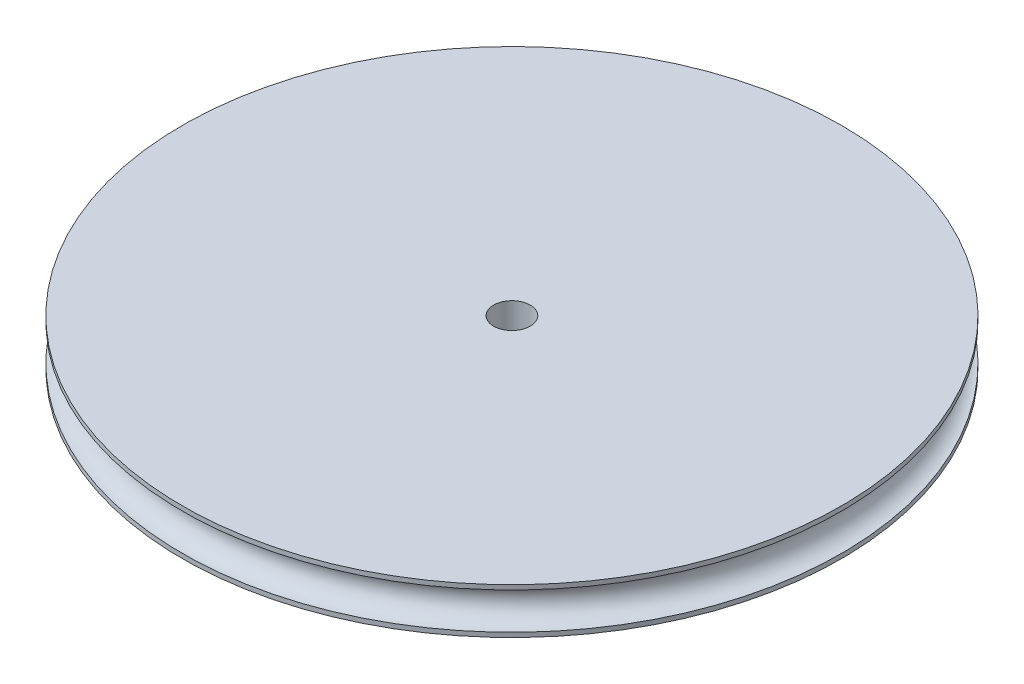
ISO-10303-21;
HEADER;
FILE_DESCRIPTION(('STEP AP214'),'2;1');
FILE_NAME('part.step','',(''),(''),'','','');
FILE_SCHEMA(('AUTOMOTIVE_DESIGN { 1 0 10303 214 1 1 1 1 }'));
ENDSEC;
DATA;
#1=APPLICATION_CONTEXT('core data for automotive mechanical design processes');
#2=APPLICATION_PROTOCOL_DEFINITION('international standard','automotive_design',2000,#1);
#3=PRODUCT_CONTEXT('',#1,'mechanical');
#4=PRODUCT('Part','Part','',(#3));
#5=PRODUCT_RELATED_PRODUCT_CATEGORY('part','',(#4));
#6=PRODUCT_DEFINITION_FORMATION('','',#4);
#7=PRODUCT_DEFINITION_CONTEXT('part definition',#1,'design');
#8=PRODUCT_DEFINITION('design','',#6,#7);
#9=PRODUCT_DEFINITION_SHAPE('','',#8);
#10=(LENGTH_UNIT() NAMED_UNIT(*) SI_UNIT(.MILLI.,.METRE.));
#11=(NAMED_UNIT(*) PLANE_ANGLE_UNIT() SI_UNIT($,.RADIAN.));
#12=(NAMED_UNIT(*) SI_UNIT($,.STERADIAN.) SOLID_ANGLE_UNIT());
#13=UNCERTAINTY_MEASURE_WITH_UNIT(LENGTH_MEASURE(1.E-05),#10,'distance_accuracy_value','');
#14=(GEOMETRIC_REPRESENTATION_CONTEXT(3) GLOBAL_UNCERTAINTY_ASSIGNED_CONTEXT((#13)) GLOBAL_UNIT_ASSIGNED_CONTEXT((#10,
#11,#12)) REPRESENTATION_CONTEXT('',''));
#15=CARTESIAN_POINT('',(0.,0.,0.));
#16=DIRECTION('',(0.,0.,1.));
#17=DIRECTION('',(1.,0.,0.));
#18=AXIS2_PLACEMENT_3D('',#15,#16,#17);
#19=CARTESIAN_POINT('',(0.,0.,0.));
#20=DIRECTION('',(0.,-1.,0.));
#21=DIRECTION('',(0.,0.,-1.));
#22=AXIS2_PLACEMENT_3D('',#19,#20,#21);
#23=PLANE('',#22);
#24=CARTESIAN_POINT('',(0.,0.,0.));
#25=DIRECTION('',(0.,-1.,0.));
#26=DIRECTION('',(0.,0.,-1.));
#27=AXIS2_PLACEMENT_3D('',#24,#25,#26);
#28=CIRCLE('',#27,3.175);
#29=CARTESIAN_POINT('',(0.,0.,-3.175));
#30=VERTEX_POINT('',#29);
#31=EDGE_CURVE('E49',#30,#30,#28,.F.);
#32=ORIENTED_EDGE('',*,*,#31,.T.);
#33=EDGE_LOOP('',(#32));
#34=FACE_BOUND('',#33,.T.);
#35=CARTESIAN_POINT('',(0.,0.,0.));
#36=DIRECTION('',(0.,-1.,0.));
#37=DIRECTION('',(0.,0.,-1.));
#38=AXIS2_PLACEMENT_3D('',#35,#36,#37);
#39=CIRCLE('',#38,57.15);
#40=CARTESIAN_POINT('',(0.,0.,-57.15));
#41=VERTEX_POINT('',#40);
#42=EDGE_CURVE('E10',#41,#41,#39,.T.);
#43=ORIENTED_EDGE('',*,*,#42,.T.);
#44=EDGE_LOOP('',(#43));
#45=FACE_BOUND('',#44,.T.);
#46=ADVANCED_FACE('F29',(#34,#45),#23,.T.);
#47=CARTESIAN_POINT('',(0.,0.,0.));
#48=DIRECTION('',(0.,-1.,0.));
#49=DIRECTION('',(0.,0.,-1.));
#50=AXIS2_PLACEMENT_3D('',#47,#48,#49);
#51=CYLINDRICAL_SURFACE('',#50,57.15);
#52=CARTESIAN_POINT('',(0.,0.79375,0.));
#53=DIRECTION('',(0.,-1.,0.));
#54=DIRECTION('',(0.,0.,-1.));
#55=AXIS2_PLACEMENT_3D('',#52,#53,#54);
#56=CIRCLE('',#55,57.15);
#57=CARTESIAN_POINT('',(0.,0.79375,-57.15));
#58=VERTEX_POINT('',#57);
#59=EDGE_CURVE('E35',#58,#58,#56,.T.);
#60=ORIENTED_EDGE('',*,*,#59,.T.);
#61=EDGE_LOOP('',(#60));
#62=FACE_BOUND('',#61,.T.);
#63=ORIENTED_EDGE('',*,*,#42,.F.);
#64=EDGE_LOOP('',(#63));
#65=FACE_BOUND('',#64,.T.);
#66=ADVANCED_FACE('F72',(#62,#65),#51,.T.);
#67=CARTESIAN_POINT('',(0.,3.96875,0.));
#68=DIRECTION('',(0.,-1.,0.));
#69=DIRECTION('',(0.,0.,-1.));
#70=AXIS2_PLACEMENT_3D('',#67,#68,#69);
#71=TOROIDAL_SURFACE('',#70,57.15,3.175);
#72=CARTESIAN_POINT('',(0.,7.14375,0.));
#73=DIRECTION('',(0.,-1.,0.));
#74=DIRECTION('',(0.,0.,-1.));
#75=AXIS2_PLACEMENT_3D('',#72,#73,#74);
#76=CIRCLE('',#75,57.15);
#77=CARTESIAN_POINT('',(0.,7.14375,-57.15));
#78=VERTEX_POINT('',#77);
#79=EDGE_CURVE('E39',#78,#78,#76,.T.);
#80=ORIENTED_EDGE('',*,*,#79,.T.);
#81=EDGE_LOOP('',(#80));
#82=FACE_BOUND('',#81,.T.);
#83=ORIENTED_EDGE('',*,*,#59,.F.);
#84=EDGE_LOOP('',(#83));
#85=FACE_BOUND('',#84,.T.);
#86=ADVANCED_FACE('F66',(#82,#85),#71,.F.);
#87=CARTESIAN_POINT('',(0.,0.,0.));
#88=DIRECTION('',(0.,-1.,0.));
#89=DIRECTION('',(0.,0.,-1.));
#90=AXIS2_PLACEMENT_3D('',#87,#88,#89);
#91=CYLINDRICAL_SURFACE('',#90,57.15);
#92=CARTESIAN_POINT('',(0.,7.9375,0.));
#93=DIRECTION('',(0.,-1.,0.));
#94=DIRECTION('',(0.,0.,-1.));
#95=AXIS2_PLACEMENT_3D('',#92,#93,#94);
#96=CIRCLE('',#95,57.15);
#97=CARTESIAN_POINT('',(0.,7.9375,-57.15));
#98=VERTEX_POINT('',#97);
#99=EDGE_CURVE('E43',#98,#98,#96,.T.);
#100=ORIENTED_EDGE('',*,*,#99,.T.);
#101=EDGE_LOOP('',(#100));
#102=FACE_BOUND('',#101,.T.);
#103=ORIENTED_EDGE('',*,*,#79,.F.);
#104=EDGE_LOOP('',(#103));
#105=FACE_BOUND('',#104,.T.);
#106=ADVANCED_FACE('F60',(#102,#105),#91,.T.);
#107=CARTESIAN_POINT('',(0.,7.9375,0.));
#108=DIRECTION('',(0.,1.,0.));
#109=DIRECTION('',(0.,0.,1.));
#110=AXIS2_PLACEMENT_3D('',#107,#108,#109);
#111=PLANE('',#110);
#112=CARTESIAN_POINT('',(0.,7.9375,0.));
#113=DIRECTION('',(0.,1.,0.));
#114=DIRECTION('',(0.,0.,1.));
#115=AXIS2_PLACEMENT_3D('',#112,#113,#114);
#116=CIRCLE('',#115,3.175);
#117=CARTESIAN_POINT('',(0.,7.9375,3.175));
#118=VERTEX_POINT('',#117);
#119=EDGE_CURVE('E48',#118,#118,#116,.T.);
#120=ORIENTED_EDGE('',*,*,#119,.F.);
#121=EDGE_LOOP('',(#120));
#122=FACE_BOUND('',#121,.T.);
#123=ORIENTED_EDGE('',*,*,#99,.F.);
#124=EDGE_LOOP('',(#123));
#125=FACE_BOUND('',#124,.T.);
#126=ADVANCED_FACE('F57',(#122,#125),#111,.T.);
#127=CARTESIAN_POINT('',(0.,-0.000999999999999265,0.));
#128=DIRECTION('',(0.,1.,0.));
#129=DIRECTION('',(0.,0.,1.));
#130=AXIS2_PLACEMENT_3D('',#127,#128,#129);
#131=CYLINDRICAL_SURFACE('',#130,3.175);
#132=ORIENTED_EDGE('',*,*,#31,.F.);
#133=EDGE_LOOP('',(#132));
#134=FACE_BOUND('',#133,.T.);
#135=ORIENTED_EDGE('',*,*,#119,.T.);
#136=EDGE_LOOP('',(#135));
#137=FACE_BOUND('',#136,.T.);
#138=ADVANCED_FACE('F55',(#134,#137),#131,.F.);
#139=CLOSED_SHELL('',(#46,#66,#86,#106,#126,#138));
#140=MANIFOLD_SOLID_BREP('B2',#139);
#141=ADVANCED_BREP_SHAPE_REPRESENTATION('',(#18,#140),#14);
#142=SHAPE_DEFINITION_REPRESENTATION(#9,#141);
ENDSEC;
END-ISO-10303-21;
